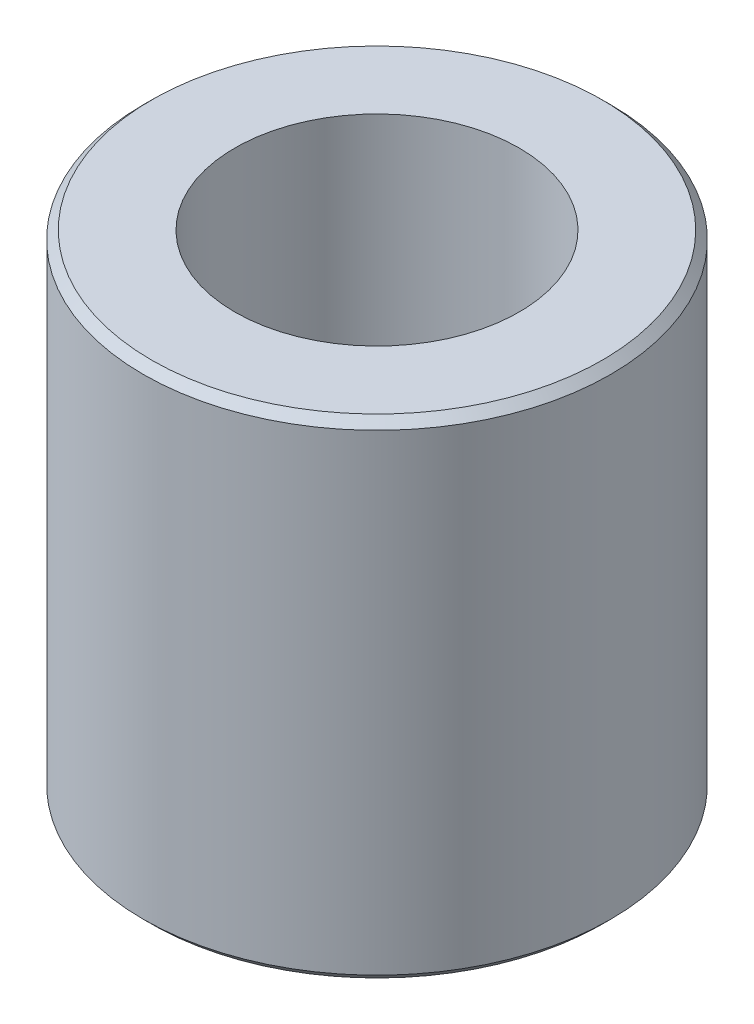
ISO-10303-21;
HEADER;
FILE_DESCRIPTION(('STEP AP214'),'2;1');
FILE_NAME('part.step','',(''),(''),'','','');
FILE_SCHEMA(('AUTOMOTIVE_DESIGN { 1 0 10303 214 1 1 1 1 }'));
ENDSEC;
DATA;
#1=APPLICATION_CONTEXT('core data for automotive mechanical design processes');
#2=APPLICATION_PROTOCOL_DEFINITION('international standard','automotive_design',2000,#1);
#3=PRODUCT_CONTEXT('',#1,'mechanical');
#4=PRODUCT('Part','Part','',(#3));
#5=PRODUCT_RELATED_PRODUCT_CATEGORY('part','',(#4));
#6=PRODUCT_DEFINITION_FORMATION('','',#4);
#7=PRODUCT_DEFINITION_CONTEXT('part definition',#1,'design');
#8=PRODUCT_DEFINITION('design','',#6,#7);
#9=PRODUCT_DEFINITION_SHAPE('','',#8);
#10=(LENGTH_UNIT() NAMED_UNIT(*) SI_UNIT(.MILLI.,.METRE.));
#11=(NAMED_UNIT(*) PLANE_ANGLE_UNIT() SI_UNIT($,.RADIAN.));
#12=(NAMED_UNIT(*) SI_UNIT($,.STERADIAN.) SOLID_ANGLE_UNIT());
#13=UNCERTAINTY_MEASURE_WITH_UNIT(LENGTH_MEASURE(1.E-05),#10,'distance_accuracy_value','');
#14=(GEOMETRIC_REPRESENTATION_CONTEXT(3) GLOBAL_UNCERTAINTY_ASSIGNED_CONTEXT((#13)) GLOBAL_UNIT_ASSIGNED_CONTEXT((#10,
#11,#12)) REPRESENTATION_CONTEXT('',''));
#15=CARTESIAN_POINT('',(0.,0.,0.));
#16=DIRECTION('',(0.,0.,1.));
#17=DIRECTION('',(1.,0.,0.));
#18=AXIS2_PLACEMENT_3D('',#15,#16,#17);
#19=CARTESIAN_POINT('',(0.,4.86357961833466,0.));
#20=DIRECTION('',(0.,1.,0.));
#21=DIRECTION('',(0.,0.,1.));
#22=AXIS2_PLACEMENT_3D('',#19,#20,#21);
#23=CYLINDRICAL_SURFACE('',#22,9.525);
#24=CARTESIAN_POINT('',(0.,-16.0274,0.));
#25=DIRECTION('',(0.,1.,0.));
#26=DIRECTION('',(0.,0.,1.));
#27=AXIS2_PLACEMENT_3D('',#24,#25,#26);
#28=CIRCLE('',#27,9.525);
#29=CARTESIAN_POINT('',(0.,-16.0274,9.525));
#30=VERTEX_POINT('',#29);
#31=EDGE_CURVE('E208',#30,#30,#28,.T.);
#32=ORIENTED_EDGE('',*,*,#31,.T.);
#33=EDGE_LOOP('',(#32));
#34=FACE_BOUND('',#33,.T.);
#35=CARTESIAN_POINT('',(0.,-18.8849,0.));
#36=DIRECTION('',(0.,-1.,0.));
#37=DIRECTION('',(0.,0.,-1.));
#38=AXIS2_PLACEMENT_3D('',#35,#36,#37);
#39=CIRCLE('',#38,9.525);
#40=CARTESIAN_POINT('',(0.,-18.8849,-9.525));
#41=VERTEX_POINT('',#40);
#42=CARTESIAN_POINT('',(-8.24889197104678,-18.8849,-4.76250000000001));
#43=VERTEX_POINT('',#42);
#44=EDGE_CURVE('E277',#41,#43,#39,.F.);
#45=ORIENTED_EDGE('',*,*,#44,.F.);
#46=CARTESIAN_POINT('',(8.24889197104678,-18.8849,-4.76249999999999));
#47=VERTEX_POINT('',#46);
#48=EDGE_CURVE('E55',#47,#41,#39,.F.);
#49=ORIENTED_EDGE('',*,*,#48,.F.);
#50=CARTESIAN_POINT('',(8.24889197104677,-18.8849,4.7625));
#51=VERTEX_POINT('',#50);
#52=EDGE_CURVE('E148',#51,#47,#39,.F.);
#53=ORIENTED_EDGE('',*,*,#52,.F.);
#54=CARTESIAN_POINT('',(0.,-18.8849,9.525));
#55=VERTEX_POINT('',#54);
#56=EDGE_CURVE('E336',#55,#51,#39,.F.);
#57=ORIENTED_EDGE('',*,*,#56,.F.);
#58=CARTESIAN_POINT('',(-8.24889197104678,-18.8849,4.7625));
#59=VERTEX_POINT('',#58);
#60=EDGE_CURVE('E333',#59,#55,#39,.F.);
#61=ORIENTED_EDGE('',*,*,#60,.F.);
#62=EDGE_CURVE('E330',#43,#59,#39,.F.);
#63=ORIENTED_EDGE('',*,*,#62,.F.);
#64=EDGE_LOOP('',(#45,#49,#53,#57,#61,#63));
#65=FACE_BOUND('',#64,.T.);
#66=ADVANCED_FACE('F36',(#34,#65),#23,.F.);
#67=CARTESIAN_POINT('',(0.,-29.9974,0.));
#68=DIRECTION('',(0.,-1.,0.));
#69=DIRECTION('',(0.,0.,-1.));
#70=AXIS2_PLACEMENT_3D('',#67,#68,#69);
#71=CONICAL_SURFACE('',#70,10.541,0.785398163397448);
#72=CARTESIAN_POINT('',(5.99105714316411,-29.9976,-8.67318463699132));
#73=CARTESIAN_POINT('',(6.15496685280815,-29.8571811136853,-8.38928469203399));
#74=CARTESIAN_POINT('',(6.3213141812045,-29.7271285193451,-8.10116266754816));
#75=CARTESIAN_POINT('',(6.65911812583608,-29.4930481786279,-7.51606907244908));
#76=CARTESIAN_POINT('',(6.83059006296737,-29.3891095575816,-7.21907096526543));
#77=CARTESIAN_POINT('',(7.17592337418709,-29.2145054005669,-6.62093612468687));
#78=CARTESIAN_POINT('',(7.34973996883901,-29.143497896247,-6.31987695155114));
#79=CARTESIAN_POINT('',(7.6123771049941,-29.0645301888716,-5.86497608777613));
#80=CARTESIAN_POINT('',(7.70019917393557,-29.0428020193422,-5.71286380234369));
#81=CARTESIAN_POINT('',(7.87629844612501,-29.0089000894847,-5.40785091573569));
#82=CARTESIAN_POINT('',(7.96457556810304,-28.9967246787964,-5.25495045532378));
#83=CARTESIAN_POINT('',(8.13620536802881,-28.982612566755,-4.95767892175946));
#84=CARTESIAN_POINT('',(8.21954684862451,-28.9801232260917,-4.8133272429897));
#85=CARTESIAN_POINT('',(8.38617582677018,-28.9838999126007,-4.52471738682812));
#86=CARTESIAN_POINT('',(8.46946332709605,-28.990165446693,-4.38045920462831));
#87=CARTESIAN_POINT('',(8.63579916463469,-29.0113385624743,-4.09235708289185));
#88=CARTESIAN_POINT('',(8.71884738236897,-29.0262498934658,-3.94851335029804));
#89=CARTESIAN_POINT('',(8.88446549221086,-29.0644352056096,-3.66165436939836));
#90=CARTESIAN_POINT('',(8.96703531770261,-29.0877103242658,-3.51863923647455));
#91=CARTESIAN_POINT('',(9.21363421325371,-29.1694654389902,-3.09151742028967));
#92=CARTESIAN_POINT('',(9.37669802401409,-29.2398948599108,-2.80908261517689));
#93=CARTESIAN_POINT('',(9.69918323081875,-29.4083768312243,-2.25052185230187));
#94=CARTESIAN_POINT('',(9.85860360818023,-29.5064370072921,-1.97439765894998));
#95=CARTESIAN_POINT('',(10.0990127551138,-29.6736973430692,-1.55799680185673));
#96=CARTESIAN_POINT('',(10.1814712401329,-29.7346434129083,-1.41517451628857));
#97=CARTESIAN_POINT('',(10.3450418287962,-29.8620907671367,-1.13186194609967));
#98=CARTESIAN_POINT('',(10.4261570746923,-29.9285758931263,-0.991366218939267));
#99=CARTESIAN_POINT('',(10.5067267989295,-29.9976,-0.851815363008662));
#100=B_SPLINE_CURVE_WITH_KNOTS('',3,(#72,#73,#74,#75,#76,#77,#78,#79,#80,#81,#82,#83,#84,#85,
#86,#87,#88,#89,#90,#91,#92,#93,#94,#95,#96,#97,#98,#99),.UNSPECIFIED.,.F.,.F.,(4,2,2,2,2,2,2,2,
2,2,2,2,2,4),(0.,1.07028880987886,2.14418228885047,3.20665958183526,3.73739210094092,
4.26803290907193,4.76791144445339,5.26776182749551,5.76782913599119,6.26796448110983,
7.26736512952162,8.26704186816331,8.79440424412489,9.32027874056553),.UNSPECIFIED.);
#101=CARTESIAN_POINT('',(5.99129058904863,-29.9974,-8.67278029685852));
#102=VERTEX_POINT('',#101);
#103=CARTESIAN_POINT('',(10.5064933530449,-29.9974,-0.852219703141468));
#104=VERTEX_POINT('',#103);
#105=EDGE_CURVE('E264',#102,#104,#100,.T.);
#106=ORIENTED_EDGE('',*,*,#105,.F.);
#107=CARTESIAN_POINT('',(0.,-29.9974,0.));
#108=DIRECTION('',(0.,-1.,0.));
#109=DIRECTION('',(0.,0.,-1.));
#110=AXIS2_PLACEMENT_3D('',#107,#108,#109);
#111=CIRCLE('',#110,10.541);
#112=EDGE_CURVE('E231',#104,#102,#111,.F.);
#113=ORIENTED_EDGE('',*,*,#112,.F.);
#114=EDGE_LOOP('',(#106,#113));
#115=FACE_BOUND('',#114,.T.);
#116=ADVANCED_FACE('F318',(#115),#71,.F.);
#117=CARTESIAN_POINT('',(-11.2926452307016,-34.2296684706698,-9.52500000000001));
#118=CARTESIAN_POINT('',(-11.0190966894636,-34.0206159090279,-9.52500000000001));
#119=CARTESIAN_POINT('',(-10.7440535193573,-33.8134879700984,-9.52500000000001));
#120=CARTESIAN_POINT('',(-10.1903745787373,-33.4039543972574,-9.52500000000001));
#121=CARTESIAN_POINT('',(-9.91173795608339,-33.2015499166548,-9.52500000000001));
#122=CARTESIAN_POINT('',(-9.34823094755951,-32.800895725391,-9.52500000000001));
#123=CARTESIAN_POINT('',(-9.06332902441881,-32.6026902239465,-9.52500000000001));
#124=CARTESIAN_POINT('',(-8.48874856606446,-32.2133514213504,-9.52500000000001));
#125=CARTESIAN_POINT('',(-8.19907036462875,-32.0222176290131,-9.52500000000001));
#126=CARTESIAN_POINT('',(-7.59626893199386,-31.6371993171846,-9.52500000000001));
#127=CARTESIAN_POINT('',(-7.28279506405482,-31.4438610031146,-9.52500000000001));
#128=CARTESIAN_POINT('',(-6.64849921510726,-31.0694360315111,-9.52500000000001));
#129=CARTESIAN_POINT('',(-6.32767603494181,-30.8883513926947,-9.52500000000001));
#130=CARTESIAN_POINT('',(-5.67863583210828,-30.5423087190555,-9.52500000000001));
#131=CARTESIAN_POINT('',(-5.35044427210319,-30.3773032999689,-9.52500000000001));
#132=CARTESIAN_POINT('',(-4.68489798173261,-30.0671151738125,-9.52500000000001));
#133=CARTESIAN_POINT('',(-4.34754760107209,-29.9219232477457,-9.52500000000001));
#134=CARTESIAN_POINT('',(-3.69464021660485,-29.6688462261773,-9.52500000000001));
#135=CARTESIAN_POINT('',(-3.37994750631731,-29.5587541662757,-9.52500000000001));
#136=CARTESIAN_POINT('',(-2.74270158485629,-29.3637767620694,-9.52500000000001));
#137=CARTESIAN_POINT('',(-2.42014786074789,-29.2788930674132,-9.525));
#138=CARTESIAN_POINT('',(-1.77463139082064,-29.1402811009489,-9.525));
#139=CARTESIAN_POINT('',(-1.45178966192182,-29.0859986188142,-9.525));
#140=CARTESIAN_POINT('',(-0.802295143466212,-29.0096947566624,-9.525));
#141=CARTESIAN_POINT('',(-0.47564310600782,-28.9876671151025,-9.525));
#142=CARTESIAN_POINT('',(0.164816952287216,-28.9776638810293,-9.525));
#143=CARTESIAN_POINT('',(0.4786041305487,-28.9883330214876,-9.525));
#144=CARTESIAN_POINT('',(1.10364638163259,-29.0400631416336,-9.525));
#145=CARTESIAN_POINT('',(1.41490121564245,-29.0811269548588,-9.525));
#146=CARTESIAN_POINT('',(2.03789554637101,-29.1920519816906,-9.525));
#147=CARTESIAN_POINT('',(2.34954421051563,-29.2624149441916,-9.525));
#148=CARTESIAN_POINT('',(2.96600664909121,-29.4280891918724,-9.525));
#149=CARTESIAN_POINT('',(3.27082087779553,-29.523398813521,-9.525));
#150=CARTESIAN_POINT('',(3.89409612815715,-29.7422422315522,-9.525));
#151=CARTESIAN_POINT('',(4.21202221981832,-29.8672829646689,-9.525));
#152=CARTESIAN_POINT('',(4.83967162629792,-30.1366445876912,-9.525));
#153=CARTESIAN_POINT('',(5.1493911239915,-30.2809742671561,-9.525));
#154=CARTESIAN_POINT('',(5.76210644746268,-30.5854878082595,-9.525));
#155=CARTESIAN_POINT('',(6.06507764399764,-30.7457208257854,-9.525));
#156=CARTESIAN_POINT('',(6.66406818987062,-31.0785098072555,-9.525));
#157=CARTESIAN_POINT('',(6.96008861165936,-31.2510638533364,-9.525));
#158=CARTESIAN_POINT('',(7.53159139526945,-31.5972986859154,-9.525));
#159=CARTESIAN_POINT('',(7.80736513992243,-31.7705010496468,-9.525));
#160=CARTESIAN_POINT('',(8.35417563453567,-32.1242504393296,-9.525));
#161=CARTESIAN_POINT('',(8.6252120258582,-32.3047980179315,-9.525));
#162=CARTESIAN_POINT('',(9.16098220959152,-32.670450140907,-9.525));
#163=CARTESIAN_POINT('',(9.42574919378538,-32.8555062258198,-9.525));
#164=CARTESIAN_POINT('',(9.95165516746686,-33.2305581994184,-9.525));
#165=CARTESIAN_POINT('',(10.2127951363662,-33.4205527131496,-9.525));
#166=CARTESIAN_POINT('',(10.4724144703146,-33.6125679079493,-9.525));
#167=B_SPLINE_CURVE_WITH_KNOTS('',3,(#117,#118,#119,#120,#121,#122,#123,#124,#125,#126,#127,
#128,#129,#130,#131,#132,#133,#134,#135,#136,#137,#138,#139,#140,#141,#142,#143,#144,#145,#146,
#147,#148,#149,#150,#151,#152,#153,#154,#155,#156,#157,#158,#159,#160,#161,#162,#163,#164,#165,
#166),.UNSPECIFIED.,.F.,.F.,(4,2,2,2,2,2,2,2,2,2,2,2,2,2,2,2,2,2,2,2,2,2,2,2,4),(0.,
1.03287280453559,2.06599521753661,3.10710346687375,4.14813926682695,5.25281933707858,
6.35768095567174,7.45918137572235,8.56016751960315,9.55948271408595,10.5588632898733,
11.5395094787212,12.5199652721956,13.4603390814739,14.4008005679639,15.3580767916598,
16.3152891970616,17.3393947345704,18.3639685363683,19.3918141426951,20.4195001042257,
21.3963241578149,22.3732218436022,23.3422455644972,24.3110023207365),.UNSPECIFIED.);
#168=CARTESIAN_POINT('',(-4.51520276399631,-29.9974,-9.52500000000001));
#169=VERTEX_POINT('',#168);
#170=CARTESIAN_POINT('',(4.51520276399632,-29.9974,-9.525));
#171=VERTEX_POINT('',#170);
#172=EDGE_CURVE('E270',#169,#171,#167,.T.);
#173=ORIENTED_EDGE('',*,*,#172,.F.);
#174=EDGE_CURVE('E226',#171,#169,#111,.F.);
#175=ORIENTED_EDGE('',*,*,#174,.F.);
#176=EDGE_LOOP('',(#173,#175));
#177=FACE_BOUND('',#176,.T.);
#178=ADVANCED_FACE('F323',(#177),#71,.F.);
#179=CARTESIAN_POINT('',(-10.5067267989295,-29.9976,-0.851815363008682));
#180=CARTESIAN_POINT('',(-10.3428170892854,-29.8571811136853,-1.13571530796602));
#181=CARTESIAN_POINT('',(-10.1764697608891,-29.7271285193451,-1.42383733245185));
#182=CARTESIAN_POINT('',(-9.83866581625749,-29.4930481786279,-2.00893092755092));
#183=CARTESIAN_POINT('',(-9.6671938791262,-29.3891095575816,-2.30592903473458));
#184=CARTESIAN_POINT('',(-9.32186056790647,-29.2145054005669,-2.90406387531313));
#185=CARTESIAN_POINT('',(-9.14804397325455,-29.1434978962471,-3.20512304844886));
#186=CARTESIAN_POINT('',(-8.88540683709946,-29.0645301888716,-3.66002391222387));
#187=CARTESIAN_POINT('',(-8.79758476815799,-29.0428020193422,-3.81213619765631));
#188=CARTESIAN_POINT('',(-8.62148549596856,-29.0089000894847,-4.11714908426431));
#189=CARTESIAN_POINT('',(-8.53320837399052,-28.9967246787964,-4.27004954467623));
#190=CARTESIAN_POINT('',(-8.36157857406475,-28.982612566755,-4.56732107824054));
#191=CARTESIAN_POINT('',(-8.27823709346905,-28.9801232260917,-4.7116727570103));
#192=CARTESIAN_POINT('',(-8.11160811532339,-28.9838999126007,-5.00028261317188));
#193=CARTESIAN_POINT('',(-8.02832061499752,-28.990165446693,-5.14454079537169));
#194=CARTESIAN_POINT('',(-7.86198477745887,-29.0113385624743,-5.43264291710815));
#195=CARTESIAN_POINT('',(-7.77893655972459,-29.0262498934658,-5.57648664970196));
#196=CARTESIAN_POINT('',(-7.6133184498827,-29.0644352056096,-5.86334563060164));
#197=CARTESIAN_POINT('',(-7.53074862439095,-29.0877103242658,-6.00636076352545));
#198=CARTESIAN_POINT('',(-7.28414972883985,-29.1694654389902,-6.43348257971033));
#199=CARTESIAN_POINT('',(-7.12108591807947,-29.2398948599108,-6.7159173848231));
#200=CARTESIAN_POINT('',(-6.79860071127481,-29.4083768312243,-7.27447814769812));
#201=CARTESIAN_POINT('',(-6.63918033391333,-29.5064370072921,-7.55060234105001));
#202=CARTESIAN_POINT('',(-6.39877118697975,-29.6736973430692,-7.96700319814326));
#203=CARTESIAN_POINT('',(-6.3163127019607,-29.7346434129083,-8.10982548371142));
#204=CARTESIAN_POINT('',(-6.15274211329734,-29.8620907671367,-8.39313805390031));
#205=CARTESIAN_POINT('',(-6.07162686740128,-29.9285758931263,-8.53363378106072));
#206=CARTESIAN_POINT('',(-5.99105714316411,-29.9976,-8.67318463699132));
#207=B_SPLINE_CURVE_WITH_KNOTS('',3,(#179,#180,#181,#182,#183,#184,#185,#186,#187,#188,#189,
#190,#191,#192,#193,#194,#195,#196,#197,#198,#199,#200,#201,#202,#203,#204,#205,#206),
.UNSPECIFIED.,.F.,.F.,(4,2,2,2,2,2,2,2,2,2,2,2,2,4),(0.,1.07028880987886,2.14418228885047,
3.20665958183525,3.73739210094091,4.26803290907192,4.76791144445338,5.26776182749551,
5.76782913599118,6.26796448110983,7.26736512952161,8.2670418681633,8.79440424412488,
9.32027874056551),.UNSPECIFIED.);
#208=CARTESIAN_POINT('',(-10.5064933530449,-29.9974,-0.852219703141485));
#209=VERTEX_POINT('',#208);
#210=CARTESIAN_POINT('',(-5.99129058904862,-29.9974,-8.67278029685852));
#211=VERTEX_POINT('',#210);
#212=EDGE_CURVE('E403',#209,#211,#207,.T.);
#213=ORIENTED_EDGE('',*,*,#212,.F.);
#214=EDGE_CURVE('E232',#211,#209,#111,.F.);
#215=ORIENTED_EDGE('',*,*,#214,.F.);
#216=EDGE_LOOP('',(#213,#215));
#217=FACE_BOUND('',#216,.T.);
#218=ADVANCED_FACE('F384',(#217),#71,.F.);
#219=CARTESIAN_POINT('',(-5.99105714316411,-29.9976,8.67318463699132));
#220=CARTESIAN_POINT('',(-6.15496685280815,-29.8571811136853,8.38928469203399));
#221=CARTESIAN_POINT('',(-6.3213141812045,-29.7271285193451,8.10116266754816));
#222=CARTESIAN_POINT('',(-6.65911812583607,-29.4930481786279,7.51606907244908));
#223=CARTESIAN_POINT('',(-6.83059006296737,-29.3891095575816,7.21907096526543));
#224=CARTESIAN_POINT('',(-7.17592337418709,-29.2145054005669,6.62093612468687));
#225=CARTESIAN_POINT('',(-7.34973996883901,-29.143497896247,6.31987695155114));
#226=CARTESIAN_POINT('',(-7.6123771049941,-29.0645301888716,5.86497608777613));
#227=CARTESIAN_POINT('',(-7.70019917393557,-29.0428020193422,5.71286380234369));
#228=CARTESIAN_POINT('',(-7.87629844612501,-29.0089000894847,5.4078509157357));
#229=CARTESIAN_POINT('',(-7.96457556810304,-28.9967246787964,5.25495045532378));
#230=CARTESIAN_POINT('',(-8.13620536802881,-28.982612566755,4.95767892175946));
#231=CARTESIAN_POINT('',(-8.21954684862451,-28.9801232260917,4.8133272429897));
#232=CARTESIAN_POINT('',(-8.38617582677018,-28.9838999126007,4.52471738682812));
#233=CARTESIAN_POINT('',(-8.46946332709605,-28.990165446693,4.38045920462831));
#234=CARTESIAN_POINT('',(-8.63579916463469,-29.0113385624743,4.09235708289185));
#235=CARTESIAN_POINT('',(-8.71884738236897,-29.0262498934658,3.94851335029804));
#236=CARTESIAN_POINT('',(-8.88446549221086,-29.0644352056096,3.66165436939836));
#237=CARTESIAN_POINT('',(-8.96703531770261,-29.0877103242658,3.51863923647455));
#238=CARTESIAN_POINT('',(-9.21363421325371,-29.1694654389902,3.09151742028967));
#239=CARTESIAN_POINT('',(-9.37669802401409,-29.2398948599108,2.8090826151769));
#240=CARTESIAN_POINT('',(-9.69918323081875,-29.4083768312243,2.25052185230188));
#241=CARTESIAN_POINT('',(-9.85860360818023,-29.5064370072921,1.97439765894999));
#242=CARTESIAN_POINT('',(-10.0990127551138,-29.6736973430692,1.55799680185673));
#243=CARTESIAN_POINT('',(-10.1814712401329,-29.7346434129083,1.41517451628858));
#244=CARTESIAN_POINT('',(-10.3450418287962,-29.8620907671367,1.13186194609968));
#245=CARTESIAN_POINT('',(-10.4261570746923,-29.9285758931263,0.99136621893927));
#246=CARTESIAN_POINT('',(-10.5067267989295,-29.9976,0.851815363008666));
#247=B_SPLINE_CURVE_WITH_KNOTS('',3,(#219,#220,#221,#222,#223,#224,#225,#226,#227,#228,#229,
#230,#231,#232,#233,#234,#235,#236,#237,#238,#239,#240,#241,#242,#243,#244,#245,#246),
.UNSPECIFIED.,.F.,.F.,(4,2,2,2,2,2,2,2,2,2,2,2,2,4),(0.,1.07028880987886,2.14418228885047,
3.20665958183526,3.73739210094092,4.26803290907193,4.76791144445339,5.26776182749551,
5.76782913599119,6.26796448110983,7.26736512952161,8.26704186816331,8.79440424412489,
9.32027874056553),.UNSPECIFIED.);
#248=CARTESIAN_POINT('',(-5.99129058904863,-29.9974,8.67278029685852));
#249=VERTEX_POINT('',#248);
#250=CARTESIAN_POINT('',(-10.5064933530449,-29.9974,0.852219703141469));
#251=VERTEX_POINT('',#250);
#252=EDGE_CURVE('E390',#249,#251,#247,.T.);
#253=ORIENTED_EDGE('',*,*,#252,.F.);
#254=EDGE_CURVE('E393',#251,#249,#111,.F.);
#255=ORIENTED_EDGE('',*,*,#254,.F.);
#256=EDGE_LOOP('',(#253,#255));
#257=FACE_BOUND('',#256,.T.);
#258=ADVANCED_FACE('F378',(#257),#71,.F.);
#259=CARTESIAN_POINT('',(-11.2926452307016,-34.2296684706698,9.525));
#260=CARTESIAN_POINT('',(-11.0190966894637,-34.0206159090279,9.525));
#261=CARTESIAN_POINT('',(-10.7440535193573,-33.8134879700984,9.525));
#262=CARTESIAN_POINT('',(-10.1903745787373,-33.4039543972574,9.525));
#263=CARTESIAN_POINT('',(-9.9117379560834,-33.2015499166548,9.525));
#264=CARTESIAN_POINT('',(-9.34823094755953,-32.800895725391,9.525));
#265=CARTESIAN_POINT('',(-9.06332902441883,-32.6026902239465,9.525));
#266=CARTESIAN_POINT('',(-8.48874856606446,-32.2133514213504,9.525));
#267=CARTESIAN_POINT('',(-8.19907036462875,-32.0222176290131,9.525));
#268=CARTESIAN_POINT('',(-7.59626893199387,-31.6371993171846,9.525));
#269=CARTESIAN_POINT('',(-7.28279506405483,-31.4438610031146,9.525));
#270=CARTESIAN_POINT('',(-6.64849921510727,-31.0694360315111,9.525));
#271=CARTESIAN_POINT('',(-6.32767603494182,-30.8883513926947,9.525));
#272=CARTESIAN_POINT('',(-5.67863583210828,-30.5423087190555,9.525));
#273=CARTESIAN_POINT('',(-5.3504442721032,-30.3773032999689,9.525));
#274=CARTESIAN_POINT('',(-4.68489798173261,-30.0671151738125,9.525));
#275=CARTESIAN_POINT('',(-4.34754760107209,-29.9219232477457,9.525));
#276=CARTESIAN_POINT('',(-3.69464021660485,-29.6688462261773,9.525));
#277=CARTESIAN_POINT('',(-3.37994750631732,-29.5587541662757,9.525));
#278=CARTESIAN_POINT('',(-2.7427015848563,-29.3637767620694,9.525));
#279=CARTESIAN_POINT('',(-2.4201478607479,-29.2788930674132,9.525));
#280=CARTESIAN_POINT('',(-1.77463139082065,-29.1402811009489,9.525));
#281=CARTESIAN_POINT('',(-1.45178966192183,-29.0859986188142,9.525));
#282=CARTESIAN_POINT('',(-0.802295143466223,-29.0096947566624,9.525));
#283=CARTESIAN_POINT('',(-0.475643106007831,-28.9876671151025,9.525));
#284=CARTESIAN_POINT('',(0.164816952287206,-28.9776638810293,9.525));
#285=CARTESIAN_POINT('',(0.47860413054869,-28.9883330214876,9.525));
#286=CARTESIAN_POINT('',(1.10364638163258,-29.0400631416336,9.525));
#287=CARTESIAN_POINT('',(1.41490121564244,-29.0811269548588,9.525));
#288=CARTESIAN_POINT('',(2.037895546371,-29.1920519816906,9.525));
#289=CARTESIAN_POINT('',(2.34954421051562,-29.2624149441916,9.525));
#290=CARTESIAN_POINT('',(2.9660066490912,-29.4280891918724,9.525));
#291=CARTESIAN_POINT('',(3.27082087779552,-29.523398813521,9.525));
#292=CARTESIAN_POINT('',(3.89409612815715,-29.7422422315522,9.525));
#293=CARTESIAN_POINT('',(4.21202221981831,-29.8672829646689,9.525));
#294=CARTESIAN_POINT('',(4.83967162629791,-30.1366445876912,9.525));
#295=CARTESIAN_POINT('',(5.14939112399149,-30.2809742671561,9.525));
#296=CARTESIAN_POINT('',(5.76210644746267,-30.5854878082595,9.525));
#297=CARTESIAN_POINT('',(6.06507764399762,-30.7457208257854,9.525));
#298=CARTESIAN_POINT('',(6.6640681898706,-31.0785098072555,9.525));
#299=CARTESIAN_POINT('',(6.96008861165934,-31.2510638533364,9.525));
#300=CARTESIAN_POINT('',(7.53159139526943,-31.5972986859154,9.525));
#301=CARTESIAN_POINT('',(7.80736513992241,-31.7705010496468,9.525));
#302=CARTESIAN_POINT('',(8.35417563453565,-32.1242504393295,9.525));
#303=CARTESIAN_POINT('',(8.62521202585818,-32.3047980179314,9.525));
#304=CARTESIAN_POINT('',(9.1609822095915,-32.670450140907,9.525));
#305=CARTESIAN_POINT('',(9.42574919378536,-32.8555062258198,9.525));
#306=CARTESIAN_POINT('',(9.95165516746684,-33.2305581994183,9.525));
#307=CARTESIAN_POINT('',(10.2127951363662,-33.4205527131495,9.525));
#308=CARTESIAN_POINT('',(10.4724144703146,-33.6125679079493,9.525));
#309=B_SPLINE_CURVE_WITH_KNOTS('',3,(#259,#260,#261,#262,#263,#264,#265,#266,#267,#268,#269,
#270,#271,#272,#273,#274,#275,#276,#277,#278,#279,#280,#281,#282,#283,#284,#285,#286,#287,#288,
#289,#290,#291,#292,#293,#294,#295,#296,#297,#298,#299,#300,#301,#302,#303,#304,#305,#306,#307,
#308),.UNSPECIFIED.,.F.,.F.,(4,2,2,2,2,2,2,2,2,2,2,2,2,2,2,2,2,2,2,2,2,2,2,2,4),(0.,
1.0328728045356,2.06599521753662,3.10710346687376,4.14813926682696,5.2528193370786,
6.35768095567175,7.45918137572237,8.56016751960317,9.55948271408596,10.5588632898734,
11.5395094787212,12.5199652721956,13.4603390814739,14.4008005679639,15.3580767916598,
16.3152891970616,17.3393947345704,18.3639685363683,19.3918141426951,20.4195001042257,
21.3963241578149,22.3732218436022,23.3422455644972,24.3110023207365),.UNSPECIFIED.);
#310=CARTESIAN_POINT('',(4.51520276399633,-29.9974,9.525));
#311=VERTEX_POINT('',#310);
#312=CARTESIAN_POINT('',(-4.51520276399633,-29.9974,9.525));
#313=VERTEX_POINT('',#312);
#314=EDGE_CURVE('E240',#311,#313,#309,.F.);
#315=ORIENTED_EDGE('',*,*,#314,.F.);
#316=EDGE_CURVE('E388',#313,#311,#111,.F.);
#317=ORIENTED_EDGE('',*,*,#316,.F.);
#318=EDGE_LOOP('',(#315,#317));
#319=FACE_BOUND('',#318,.T.);
#320=ADVANCED_FACE('F374',(#319),#71,.F.);
#321=CARTESIAN_POINT('',(0.,-29.9974,0.));
#322=DIRECTION('',(0.,-1.,0.));
#323=DIRECTION('',(0.,0.,-1.));
#324=AXIS2_PLACEMENT_3D('',#321,#322,#323);
#325=PLANE('',#324);
#326=CARTESIAN_POINT('',(0.,-29.9974,0.));
#327=DIRECTION('',(0.,-1.,0.));
#328=DIRECTION('',(0.,0.,-1.));
#329=AXIS2_PLACEMENT_3D('',#326,#327,#328);
#330=CIRCLE('',#329,13.843);
#331=CARTESIAN_POINT('',(0.,-29.9974,-13.843));
#332=VERTEX_POINT('',#331);
#333=EDGE_CURVE('E44',#332,#332,#330,.T.);
#334=ORIENTED_EDGE('',*,*,#333,.T.);
#335=EDGE_LOOP('',(#334));
#336=FACE_BOUND('',#335,.T.);
#337=DIRECTION('',(0.499999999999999,0.,0.866025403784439));
#338=VECTOR('',#337,1.);
#339=CARTESIAN_POINT('',(5.49926131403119,-29.9974,-9.525));
#340=LINE('',#339,#338);
#341=CARTESIAN_POINT('',(5.49926131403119,-29.9974,-9.525));
#342=VERTEX_POINT('',#341);
#343=EDGE_CURVE('E184',#342,#102,#340,.T.);
#344=ORIENTED_EDGE('',*,*,#343,.F.);
#345=DIRECTION('',(1.,0.,0.));
#346=VECTOR('',#345,1.);
#347=CARTESIAN_POINT('',(-5.49926131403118,-29.9974,-9.52500000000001));
#348=LINE('',#347,#346);
#349=EDGE_CURVE('E202',#171,#342,#348,.T.);
#350=ORIENTED_EDGE('',*,*,#349,.F.);
#351=ORIENTED_EDGE('',*,*,#174,.T.);
#352=CARTESIAN_POINT('',(-5.49926131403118,-29.9974,-9.52500000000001));
#353=VERTEX_POINT('',#352);
#354=EDGE_CURVE('E150',#353,#169,#348,.T.);
#355=ORIENTED_EDGE('',*,*,#354,.F.);
#356=DIRECTION('',(0.5,0.,-0.866025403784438));
#357=VECTOR('',#356,1.);
#358=CARTESIAN_POINT('',(-10.9985226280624,-29.9974,0.));
#359=LINE('',#358,#357);
#360=EDGE_CURVE('E198',#211,#353,#359,.T.);
#361=ORIENTED_EDGE('',*,*,#360,.F.);
#362=ORIENTED_EDGE('',*,*,#214,.T.);
#363=CARTESIAN_POINT('',(-10.9985226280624,-29.9974,0.));
#364=VERTEX_POINT('',#363);
#365=EDGE_CURVE('E199',#364,#209,#359,.T.);
#366=ORIENTED_EDGE('',*,*,#365,.F.);
#367=DIRECTION('',(-0.499999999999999,0.,-0.866025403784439));
#368=VECTOR('',#367,1.);
#369=CARTESIAN_POINT('',(-5.49926131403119,-29.9974,9.525));
#370=LINE('',#369,#368);
#371=EDGE_CURVE('E194',#251,#364,#370,.T.);
#372=ORIENTED_EDGE('',*,*,#371,.F.);
#373=ORIENTED_EDGE('',*,*,#254,.T.);
#374=CARTESIAN_POINT('',(-5.49926131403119,-29.9974,9.525));
#375=VERTEX_POINT('',#374);
#376=EDGE_CURVE('E195',#375,#249,#370,.T.);
#377=ORIENTED_EDGE('',*,*,#376,.F.);
#378=DIRECTION('',(-1.,0.,0.));
#379=VECTOR('',#378,1.);
#380=CARTESIAN_POINT('',(5.49926131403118,-29.9974,9.525));
#381=LINE('',#380,#379);
#382=EDGE_CURVE('E190',#313,#375,#381,.T.);
#383=ORIENTED_EDGE('',*,*,#382,.F.);
#384=ORIENTED_EDGE('',*,*,#316,.T.);
#385=CARTESIAN_POINT('',(5.49926131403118,-29.9974,9.525));
#386=VERTEX_POINT('',#385);
#387=EDGE_CURVE('E191',#386,#311,#381,.T.);
#388=ORIENTED_EDGE('',*,*,#387,.F.);
#389=DIRECTION('',(-0.500000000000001,0.,0.866025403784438));
#390=VECTOR('',#389,1.);
#391=CARTESIAN_POINT('',(10.9985226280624,-29.9974,0.));
#392=LINE('',#391,#390);
#393=CARTESIAN_POINT('',(5.9912905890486,-29.9974,8.67278029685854));
#394=VERTEX_POINT('',#393);
#395=EDGE_CURVE('E187',#394,#386,#392,.T.);
#396=ORIENTED_EDGE('',*,*,#395,.F.);
#397=CARTESIAN_POINT('',(10.5064933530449,-29.9974,0.85221970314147));
#398=VERTEX_POINT('',#397);
#399=EDGE_CURVE('E394',#394,#398,#111,.F.);
#400=ORIENTED_EDGE('',*,*,#399,.T.);
#401=CARTESIAN_POINT('',(10.9985226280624,-29.9974,0.));
#402=VERTEX_POINT('',#401);
#403=EDGE_CURVE('E188',#402,#398,#392,.T.);
#404=ORIENTED_EDGE('',*,*,#403,.F.);
#405=EDGE_CURVE('E156',#104,#402,#340,.T.);
#406=ORIENTED_EDGE('',*,*,#405,.F.);
#407=ORIENTED_EDGE('',*,*,#112,.T.);
#408=EDGE_LOOP('',(#344,#350,#351,#355,#361,#362,#366,#372,#373,#377,#383,#384,#388,#396,#400,
#404,#406,#407));
#409=FACE_BOUND('',#408,.T.);
#410=ADVANCED_FACE('F286',(#336,#409),#325,.T.);
#411=CARTESIAN_POINT('',(0.,12.4902148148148,0.));
#412=DIRECTION('',(0.,1.,0.));
#413=DIRECTION('',(0.,0.,1.));
#414=AXIS2_PLACEMENT_3D('',#411,#412,#413);
#415=CYLINDRICAL_SURFACE('',#414,14.351);
#416=CARTESIAN_POINT('',(0.,-29.4894,0.));
#417=DIRECTION('',(0.,-1.,0.));
#418=DIRECTION('',(0.,0.,-1.));
#419=AXIS2_PLACEMENT_3D('',#416,#417,#418);
#420=CIRCLE('',#419,14.351);
#421=CARTESIAN_POINT('',(0.,-29.4894,-14.351));
#422=VERTEX_POINT('',#421);
#423=EDGE_CURVE('E281',#422,#422,#420,.F.);
#424=ORIENTED_EDGE('',*,*,#423,.T.);
#425=EDGE_LOOP('',(#424));
#426=FACE_BOUND('',#425,.T.);
#427=CARTESIAN_POINT('',(0.,-0.507999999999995,0.));
#428=DIRECTION('',(0.,1.,0.));
#429=DIRECTION('',(0.,0.,1.));
#430=AXIS2_PLACEMENT_3D('',#427,#428,#429);
#431=CIRCLE('',#430,14.351);
#432=CARTESIAN_POINT('',(0.,-0.507999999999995,14.351));
#433=VERTEX_POINT('',#432);
#434=EDGE_CURVE('E278',#433,#433,#431,.F.);
#435=ORIENTED_EDGE('',*,*,#434,.T.);
#436=EDGE_LOOP('',(#435));
#437=FACE_BOUND('',#436,.T.);
#438=ADVANCED_FACE('F293',(#426,#437),#415,.T.);
#439=CARTESIAN_POINT('',(0.,0.,0.));
#440=DIRECTION('',(0.,1.,0.));
#441=DIRECTION('',(0.,0.,1.));
#442=AXIS2_PLACEMENT_3D('',#439,#440,#441);
#443=PLANE('',#442);
#444=CARTESIAN_POINT('',(0.,0.,0.));
#445=DIRECTION('',(0.,1.,0.));
#446=DIRECTION('',(0.,0.,1.));
#447=AXIS2_PLACEMENT_3D('',#444,#445,#446);
#448=CIRCLE('',#447,13.843);
#449=CARTESIAN_POINT('',(0.,0.,13.843));
#450=VERTEX_POINT('',#449);
#451=EDGE_CURVE('E11',#450,#450,#448,.T.);
#452=ORIENTED_EDGE('',*,*,#451,.T.);
#453=EDGE_LOOP('',(#452));
#454=FACE_BOUND('',#453,.T.);
#455=CARTESIAN_POINT('',(0.,0.,0.));
#456=DIRECTION('',(0.,1.,0.));
#457=DIRECTION('',(0.,0.,1.));
#458=AXIS2_PLACEMENT_3D('',#455,#456,#457);
#459=CIRCLE('',#458,8.73125);
#460=CARTESIAN_POINT('',(0.,0.,8.73125));
#461=VERTEX_POINT('',#460);
#462=EDGE_CURVE('E223',#461,#461,#459,.T.);
#463=ORIENTED_EDGE('',*,*,#462,.F.);
#464=EDGE_LOOP('',(#463));
#465=FACE_BOUND('',#464,.T.);
#466=ADVANCED_FACE('F296',(#454,#465),#443,.T.);
#467=CARTESIAN_POINT('',(0.,0.,0.));
#468=DIRECTION('',(0.,1.,0.));
#469=DIRECTION('',(0.,0.,1.));
#470=AXIS2_PLACEMENT_3D('',#467,#468,#469);
#471=CYLINDRICAL_SURFACE('',#470,8.73124999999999);
#472=CARTESIAN_POINT('',(0.,-15.5504668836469,0.));
#473=DIRECTION('',(0.,-1.,0.));
#474=DIRECTION('',(0.,0.,-1.));
#475=AXIS2_PLACEMENT_3D('',#472,#473,#474);
#476=CIRCLE('',#475,8.73124999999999);
#477=CARTESIAN_POINT('',(0.,-15.5504668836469,-8.73124999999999));
#478=VERTEX_POINT('',#477);
#479=EDGE_CURVE('E222',#478,#478,#476,.T.);
#480=ORIENTED_EDGE('',*,*,#479,.T.);
#481=EDGE_LOOP('',(#480));
#482=FACE_BOUND('',#481,.T.);
#483=ORIENTED_EDGE('',*,*,#462,.T.);
#484=EDGE_LOOP('',(#483));
#485=FACE_BOUND('',#484,.T.);
#486=ADVANCED_FACE('F306',(#482,#485),#471,.F.);
#487=CARTESIAN_POINT('',(0.,-10.3042026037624,0.));
#488=DIRECTION('',(0.,-1.,0.));
#489=DIRECTION('',(0.,0.,-1.));
#490=AXIS2_PLACEMENT_3D('',#487,#488,#489);
#491=CONICAL_SURFACE('',#490,0.,1.02974425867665);
#492=ORIENTED_EDGE('',*,*,#31,.F.);
#493=EDGE_LOOP('',(#492));
#494=FACE_BOUND('',#493,.T.);
#495=ORIENTED_EDGE('',*,*,#479,.F.);
#496=EDGE_LOOP('',(#495));
#497=FACE_BOUND('',#496,.T.);
#498=ADVANCED_FACE('F261',(#494,#497),#491,.F.);
#499=CARTESIAN_POINT('',(10.5067267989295,-29.9976,0.851815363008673));
#500=CARTESIAN_POINT('',(10.3428170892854,-29.8571811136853,1.13571530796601));
#501=CARTESIAN_POINT('',(10.1764697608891,-29.7271285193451,1.42383733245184));
#502=CARTESIAN_POINT('',(9.83866581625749,-29.4930481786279,2.00893092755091));
#503=CARTESIAN_POINT('',(9.66719387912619,-29.3891095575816,2.30592903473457));
#504=CARTESIAN_POINT('',(9.32186056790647,-29.2145054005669,2.90406387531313));
#505=CARTESIAN_POINT('',(9.14804397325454,-29.143497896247,3.20512304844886));
#506=CARTESIAN_POINT('',(8.88540683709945,-29.0645301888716,3.66002391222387));
#507=CARTESIAN_POINT('',(8.79758476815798,-29.0428020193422,3.81213619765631));
#508=CARTESIAN_POINT('',(8.62148549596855,-29.0089000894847,4.11714908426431));
#509=CARTESIAN_POINT('',(8.53320837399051,-28.9967246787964,4.27004954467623));
#510=CARTESIAN_POINT('',(8.36157857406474,-28.982612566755,4.56732107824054));
#511=CARTESIAN_POINT('',(8.27823709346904,-28.9801232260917,4.7116727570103));
#512=CARTESIAN_POINT('',(8.11160811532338,-28.9838999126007,5.00028261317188));
#513=CARTESIAN_POINT('',(8.02832061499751,-28.990165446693,5.14454079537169));
#514=CARTESIAN_POINT('',(7.86198477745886,-29.0113385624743,5.43264291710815));
#515=CARTESIAN_POINT('',(7.77893655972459,-29.0262498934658,5.57648664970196));
#516=CARTESIAN_POINT('',(7.6133184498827,-29.0644352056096,5.86334563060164));
#517=CARTESIAN_POINT('',(7.53074862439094,-29.0877103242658,6.00636076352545));
#518=CARTESIAN_POINT('',(7.28414972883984,-29.1694654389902,6.43348257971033));
#519=CARTESIAN_POINT('',(7.12108591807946,-29.2398948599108,6.7159173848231));
#520=CARTESIAN_POINT('',(6.79860071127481,-29.4083768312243,7.27447814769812));
#521=CARTESIAN_POINT('',(6.63918033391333,-29.5064370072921,7.55060234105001));
#522=CARTESIAN_POINT('',(6.39877118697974,-29.6736973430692,7.96700319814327));
#523=CARTESIAN_POINT('',(6.31631270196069,-29.7346434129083,8.10982548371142));
#524=CARTESIAN_POINT('',(6.15274211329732,-29.8620907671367,8.39313805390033));
#525=CARTESIAN_POINT('',(6.07162686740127,-29.9285758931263,8.53363378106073));
#526=CARTESIAN_POINT('',(5.99105714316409,-29.9976,8.67318463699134));
#527=B_SPLINE_CURVE_WITH_KNOTS('',3,(#499,#500,#501,#502,#503,#504,#505,#506,#507,#508,#509,
#510,#511,#512,#513,#514,#515,#516,#517,#518,#519,#520,#521,#522,#523,#524,#525,#526),
.UNSPECIFIED.,.F.,.F.,(4,2,2,2,2,2,2,2,2,2,2,2,2,4),(0.,1.07028880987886,2.14418228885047,
3.20665958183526,3.73739210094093,4.26803290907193,4.7679114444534,5.26776182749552,
5.76782913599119,6.26796448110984,7.26736512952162,8.26704186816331,8.79440424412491,
9.32027874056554),.UNSPECIFIED.);
#528=EDGE_CURVE('E233',#398,#394,#527,.T.);
#529=ORIENTED_EDGE('',*,*,#528,.F.);
#530=ORIENTED_EDGE('',*,*,#399,.F.);
#531=EDGE_LOOP('',(#529,#530));
#532=FACE_BOUND('',#531,.T.);
#533=ADVANCED_FACE('F246',(#532),#71,.F.);
#534=CARTESIAN_POINT('',(0.,-18.8849,0.));
#535=DIRECTION('',(0.,-1.,0.));
#536=DIRECTION('',(0.,0.,-1.));
#537=AXIS2_PLACEMENT_3D('',#534,#535,#536);
#538=PLANE('',#537);
#539=ORIENTED_EDGE('',*,*,#44,.T.);
#540=DIRECTION('',(0.5,0.,-0.866025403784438));
#541=VECTOR('',#540,1.);
#542=CARTESIAN_POINT('',(-10.9985226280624,-18.8849,0.));
#543=LINE('',#542,#541);
#544=CARTESIAN_POINT('',(-5.49926131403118,-18.8849,-9.52500000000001));
#545=VERTEX_POINT('',#544);
#546=EDGE_CURVE('E177',#43,#545,#543,.T.);
#547=ORIENTED_EDGE('',*,*,#546,.T.);
#548=DIRECTION('',(1.,0.,0.));
#549=VECTOR('',#548,1.);
#550=CARTESIAN_POINT('',(-5.49926131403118,-18.8849,-9.52500000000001));
#551=LINE('',#550,#549);
#552=EDGE_CURVE('E161',#545,#41,#551,.T.);
#553=ORIENTED_EDGE('',*,*,#552,.T.);
#554=EDGE_LOOP('',(#539,#547,#553));
#555=FACE_BOUND('',#554,.T.);
#556=ADVANCED_FACE('F359',(#555),#538,.T.);
#557=ORIENTED_EDGE('',*,*,#62,.T.);
#558=DIRECTION('',(-0.499999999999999,0.,-0.866025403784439));
#559=VECTOR('',#558,1.);
#560=CARTESIAN_POINT('',(-5.49926131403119,-18.8849,9.525));
#561=LINE('',#560,#559);
#562=CARTESIAN_POINT('',(-10.9985226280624,-18.8849,0.));
#563=VERTEX_POINT('',#562);
#564=EDGE_CURVE('E173',#59,#563,#561,.T.);
#565=ORIENTED_EDGE('',*,*,#564,.T.);
#566=EDGE_CURVE('E178',#563,#43,#543,.T.);
#567=ORIENTED_EDGE('',*,*,#566,.T.);
#568=EDGE_LOOP('',(#557,#565,#567));
#569=FACE_BOUND('',#568,.T.);
#570=ADVANCED_FACE('F353',(#569),#538,.T.);
#571=ORIENTED_EDGE('',*,*,#60,.T.);
#572=DIRECTION('',(-1.,0.,0.));
#573=VECTOR('',#572,1.);
#574=CARTESIAN_POINT('',(5.49926131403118,-18.8849,9.525));
#575=LINE('',#574,#573);
#576=CARTESIAN_POINT('',(-5.49926131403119,-18.8849,9.525));
#577=VERTEX_POINT('',#576);
#578=EDGE_CURVE('E167',#55,#577,#575,.T.);
#579=ORIENTED_EDGE('',*,*,#578,.T.);
#580=EDGE_CURVE('E174',#577,#59,#561,.T.);
#581=ORIENTED_EDGE('',*,*,#580,.T.);
#582=EDGE_LOOP('',(#571,#579,#581));
#583=FACE_BOUND('',#582,.T.);
#584=ADVANCED_FACE('F347',(#583),#538,.T.);
#585=ORIENTED_EDGE('',*,*,#56,.T.);
#586=DIRECTION('',(-0.500000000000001,0.,0.866025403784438));
#587=VECTOR('',#586,1.);
#588=CARTESIAN_POINT('',(10.9985226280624,-18.8849,0.));
#589=LINE('',#588,#587);
#590=CARTESIAN_POINT('',(5.49926131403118,-18.8849,9.525));
#591=VERTEX_POINT('',#590);
#592=EDGE_CURVE('E166',#51,#591,#589,.T.);
#593=ORIENTED_EDGE('',*,*,#592,.T.);
#594=EDGE_CURVE('E169',#591,#55,#575,.T.);
#595=ORIENTED_EDGE('',*,*,#594,.T.);
#596=EDGE_LOOP('',(#585,#593,#595));
#597=FACE_BOUND('',#596,.T.);
#598=ADVANCED_FACE('F341',(#597),#538,.T.);
#599=ORIENTED_EDGE('',*,*,#52,.T.);
#600=DIRECTION('',(0.499999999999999,0.,0.866025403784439));
#601=VECTOR('',#600,1.);
#602=CARTESIAN_POINT('',(5.49926131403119,-18.8849,-9.525));
#603=LINE('',#602,#601);
#604=CARTESIAN_POINT('',(10.9985226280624,-18.8849,0.));
#605=VERTEX_POINT('',#604);
#606=EDGE_CURVE('E142',#47,#605,#603,.T.);
#607=ORIENTED_EDGE('',*,*,#606,.T.);
#608=EDGE_CURVE('E146',#605,#51,#589,.T.);
#609=ORIENTED_EDGE('',*,*,#608,.T.);
#610=EDGE_LOOP('',(#599,#607,#609));
#611=FACE_BOUND('',#610,.T.);
#612=ADVANCED_FACE('F144',(#611),#538,.T.);
#613=ORIENTED_EDGE('',*,*,#48,.T.);
#614=CARTESIAN_POINT('',(5.49926131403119,-18.8849,-9.525));
#615=VERTEX_POINT('',#614);
#616=EDGE_CURVE('E181',#41,#615,#551,.T.);
#617=ORIENTED_EDGE('',*,*,#616,.T.);
#618=EDGE_CURVE('E51',#615,#47,#603,.T.);
#619=ORIENTED_EDGE('',*,*,#618,.T.);
#620=EDGE_LOOP('',(#613,#617,#619));
#621=FACE_BOUND('',#620,.T.);
#622=ADVANCED_FACE('F260',(#621),#538,.T.);
#623=CARTESIAN_POINT('',(5.49926131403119,-18.8849,-9.525));
#624=DIRECTION('',(0.866025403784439,0.,-0.499999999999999));
#625=DIRECTION('',(-0.499999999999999,0.,-0.866025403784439));
#626=AXIS2_PLACEMENT_3D('',#623,#624,#625);
#627=PLANE('',#626);
#628=ORIENTED_EDGE('',*,*,#618,.F.);
#629=DIRECTION('',(0.,-1.,0.));
#630=VECTOR('',#629,1.);
#631=CARTESIAN_POINT('',(5.49926131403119,-18.8849,-9.525));
#632=LINE('',#631,#630);
#633=EDGE_CURVE('E205',#615,#342,#632,.T.);
#634=ORIENTED_EDGE('',*,*,#633,.T.);
#635=ORIENTED_EDGE('',*,*,#343,.T.);
#636=ORIENTED_EDGE('',*,*,#105,.T.);
#637=ORIENTED_EDGE('',*,*,#405,.T.);
#638=DIRECTION('',(0.,-1.,0.));
#639=VECTOR('',#638,1.);
#640=CARTESIAN_POINT('',(10.9985226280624,-18.8849,0.));
#641=LINE('',#640,#639);
#642=EDGE_CURVE('E153',#605,#402,#641,.T.);
#643=ORIENTED_EDGE('',*,*,#642,.F.);
#644=ORIENTED_EDGE('',*,*,#606,.F.);
#645=EDGE_LOOP('',(#628,#634,#635,#636,#637,#643,#644));
#646=FACE_BOUND('',#645,.T.);
#647=ADVANCED_FACE('F154',(#646),#627,.F.);
#648=CARTESIAN_POINT('',(-5.49926131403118,-18.8849,-9.52500000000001));
#649=DIRECTION('',(0.,0.,-1.));
#650=DIRECTION('',(-1.,0.,0.));
#651=AXIS2_PLACEMENT_3D('',#648,#649,#650);
#652=PLANE('',#651);
#653=ORIENTED_EDGE('',*,*,#552,.F.);
#654=DIRECTION('',(0.,-1.,0.));
#655=VECTOR('',#654,1.);
#656=CARTESIAN_POINT('',(-5.49926131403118,-18.8849,-9.52500000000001));
#657=LINE('',#656,#655);
#658=EDGE_CURVE('E209',#545,#353,#657,.T.);
#659=ORIENTED_EDGE('',*,*,#658,.T.);
#660=ORIENTED_EDGE('',*,*,#354,.T.);
#661=ORIENTED_EDGE('',*,*,#172,.T.);
#662=ORIENTED_EDGE('',*,*,#349,.T.);
#663=ORIENTED_EDGE('',*,*,#633,.F.);
#664=ORIENTED_EDGE('',*,*,#616,.F.);
#665=EDGE_LOOP('',(#653,#659,#660,#661,#662,#663,#664));
#666=FACE_BOUND('',#665,.T.);
#667=ADVANCED_FACE('F259',(#666),#652,.F.);
#668=CARTESIAN_POINT('',(-10.9985226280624,-18.8849,0.));
#669=DIRECTION('',(-0.866025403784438,0.,-0.5));
#670=DIRECTION('',(-0.5,0.,0.866025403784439));
#671=AXIS2_PLACEMENT_3D('',#668,#669,#670);
#672=PLANE('',#671);
#673=ORIENTED_EDGE('',*,*,#566,.F.);
#674=DIRECTION('',(0.,-1.,0.));
#675=VECTOR('',#674,1.);
#676=CARTESIAN_POINT('',(-10.9985226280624,-18.8849,0.));
#677=LINE('',#676,#675);
#678=EDGE_CURVE('E212',#563,#364,#677,.T.);
#679=ORIENTED_EDGE('',*,*,#678,.T.);
#680=ORIENTED_EDGE('',*,*,#365,.T.);
#681=ORIENTED_EDGE('',*,*,#212,.T.);
#682=ORIENTED_EDGE('',*,*,#360,.T.);
#683=ORIENTED_EDGE('',*,*,#658,.F.);
#684=ORIENTED_EDGE('',*,*,#546,.F.);
#685=EDGE_LOOP('',(#673,#679,#680,#681,#682,#683,#684));
#686=FACE_BOUND('',#685,.T.);
#687=ADVANCED_FACE('F355',(#686),#672,.F.);
#688=CARTESIAN_POINT('',(-5.49926131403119,-18.8849,9.525));
#689=DIRECTION('',(-0.866025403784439,0.,0.499999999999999));
#690=DIRECTION('',(0.5,0.,0.866025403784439));
#691=AXIS2_PLACEMENT_3D('',#688,#689,#690);
#692=PLANE('',#691);
#693=ORIENTED_EDGE('',*,*,#580,.F.);
#694=DIRECTION('',(0.,-1.,0.));
#695=VECTOR('',#694,1.);
#696=CARTESIAN_POINT('',(-5.49926131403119,-18.8849,9.525));
#697=LINE('',#696,#695);
#698=EDGE_CURVE('E215',#577,#375,#697,.T.);
#699=ORIENTED_EDGE('',*,*,#698,.T.);
#700=ORIENTED_EDGE('',*,*,#376,.T.);
#701=ORIENTED_EDGE('',*,*,#252,.T.);
#702=ORIENTED_EDGE('',*,*,#371,.T.);
#703=ORIENTED_EDGE('',*,*,#678,.F.);
#704=ORIENTED_EDGE('',*,*,#564,.F.);
#705=EDGE_LOOP('',(#693,#699,#700,#701,#702,#703,#704));
#706=FACE_BOUND('',#705,.T.);
#707=ADVANCED_FACE('F349',(#706),#692,.F.);
#708=CARTESIAN_POINT('',(5.49926131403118,-18.8849,9.525));
#709=DIRECTION('',(0.,0.,1.));
#710=DIRECTION('',(1.,0.,0.));
#711=AXIS2_PLACEMENT_3D('',#708,#709,#710);
#712=PLANE('',#711);
#713=ORIENTED_EDGE('',*,*,#594,.F.);
#714=DIRECTION('',(0.,-1.,0.));
#715=VECTOR('',#714,1.);
#716=CARTESIAN_POINT('',(5.49926131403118,-18.8849,9.525));
#717=LINE('',#716,#715);
#718=EDGE_CURVE('E160',#591,#386,#717,.T.);
#719=ORIENTED_EDGE('',*,*,#718,.T.);
#720=ORIENTED_EDGE('',*,*,#387,.T.);
#721=ORIENTED_EDGE('',*,*,#314,.T.);
#722=ORIENTED_EDGE('',*,*,#382,.T.);
#723=ORIENTED_EDGE('',*,*,#698,.F.);
#724=ORIENTED_EDGE('',*,*,#578,.F.);
#725=EDGE_LOOP('',(#713,#719,#720,#721,#722,#723,#724));
#726=FACE_BOUND('',#725,.T.);
#727=ADVANCED_FACE('F253',(#726),#712,.F.);
#728=CARTESIAN_POINT('',(10.9985226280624,-18.8849,0.));
#729=DIRECTION('',(0.866025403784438,0.,0.500000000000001));
#730=DIRECTION('',(0.500000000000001,0.,-0.866025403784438));
#731=AXIS2_PLACEMENT_3D('',#728,#729,#730);
#732=PLANE('',#731);
#733=ORIENTED_EDGE('',*,*,#608,.F.);
#734=ORIENTED_EDGE('',*,*,#642,.T.);
#735=ORIENTED_EDGE('',*,*,#403,.T.);
#736=ORIENTED_EDGE('',*,*,#528,.T.);
#737=ORIENTED_EDGE('',*,*,#395,.T.);
#738=ORIENTED_EDGE('',*,*,#718,.F.);
#739=ORIENTED_EDGE('',*,*,#592,.F.);
#740=EDGE_LOOP('',(#733,#734,#735,#736,#737,#738,#739));
#741=FACE_BOUND('',#740,.T.);
#742=ADVANCED_FACE('F164',(#741),#732,.F.);
#743=CARTESIAN_POINT('',(0.,-29.4894,0.));
#744=DIRECTION('',(0.,1.,0.));
#745=DIRECTION('',(0.,0.,1.));
#746=AXIS2_PLACEMENT_3D('',#743,#744,#745);
#747=CONICAL_SURFACE('',#746,14.351,0.785398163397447);
#748=ORIENTED_EDGE('',*,*,#333,.F.);
#749=EDGE_LOOP('',(#748));
#750=FACE_BOUND('',#749,.T.);
#751=ORIENTED_EDGE('',*,*,#423,.F.);
#752=EDGE_LOOP('',(#751));
#753=FACE_BOUND('',#752,.T.);
#754=ADVANCED_FACE('F252',(#750,#753),#747,.T.);
#755=CARTESIAN_POINT('',(0.,0.,0.));
#756=DIRECTION('',(0.,-1.,0.));
#757=DIRECTION('',(0.,0.,-1.));
#758=AXIS2_PLACEMENT_3D('',#755,#756,#757);
#759=CONICAL_SURFACE('',#758,13.843,0.785398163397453);
#760=ORIENTED_EDGE('',*,*,#434,.F.);
#761=EDGE_LOOP('',(#760));
#762=FACE_BOUND('',#761,.T.);
#763=ORIENTED_EDGE('',*,*,#451,.F.);
#764=EDGE_LOOP('',(#763));
#765=FACE_BOUND('',#764,.T.);
#766=ADVANCED_FACE('F38',(#762,#765),#759,.T.);
#767=CLOSED_SHELL('',(#66,#116,#178,#218,#258,#320,#410,#438,#466,#486,#498,#533,#556,#570,#584,
#598,#612,#622,#647,#667,#687,#707,#727,#742,#754,#766));
#768=MANIFOLD_SOLID_BREP('B2',#767);
#769=ADVANCED_BREP_SHAPE_REPRESENTATION('',(#18,#768),#14);
#770=SHAPE_DEFINITION_REPRESENTATION(#9,#769);
ENDSEC;
END-ISO-10303-21;
